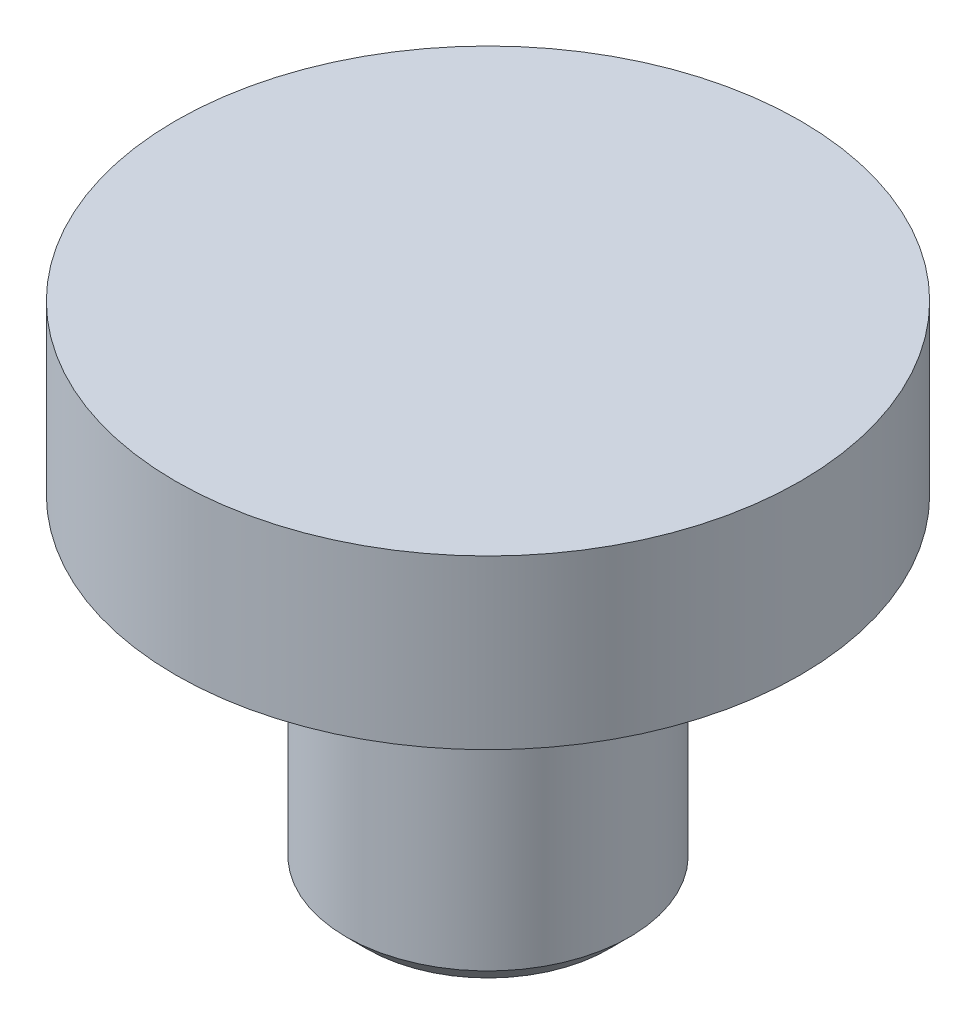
from build123d import *

# Parameters (mm, degrees)
ESQUISSE1_R      = 3.4
EXTRUSION1_DEPTH = 8
ESQUISSE2_R      = 7.5
EXTRUSION2_DEPTH = 4.028586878
CHANFREIN1_SIZE  = 0.5


with BuildPart() as part:
    # Esquisse1 → Extrusion1 (new body)
    with BuildSketch(Plane(origin=(0, 0, 0), x_dir=(1, 0, 0), z_dir=(0, 1, 0))):
        with Locations(Location((0, 0, 0), (0, 0, 270))):
            Circle(ESQUISSE1_R)
    extrude(amount=EXTRUSION1_DEPTH)

    # Esquisse2 → Extrusion2 (add)
    with BuildSketch(Plane(origin=(0, 8, 0), x_dir=(1, 0, 0), z_dir=(0, 1, 0))):
        with Locations(Location((0, 0, 0), (0, 0, 270))):
            Circle(ESQUISSE2_R)
    extrude(amount=EXTRUSION2_DEPTH)

    # Chanfrein1
    chanfrein1_edges = [part.edges().sort_by_distance(p)[0] for p in [
        (0, 0, -3.4),
    ]]
    chamfer(chanfrein1_edges, length=CHANFREIN1_SIZE)


solid = part.part
